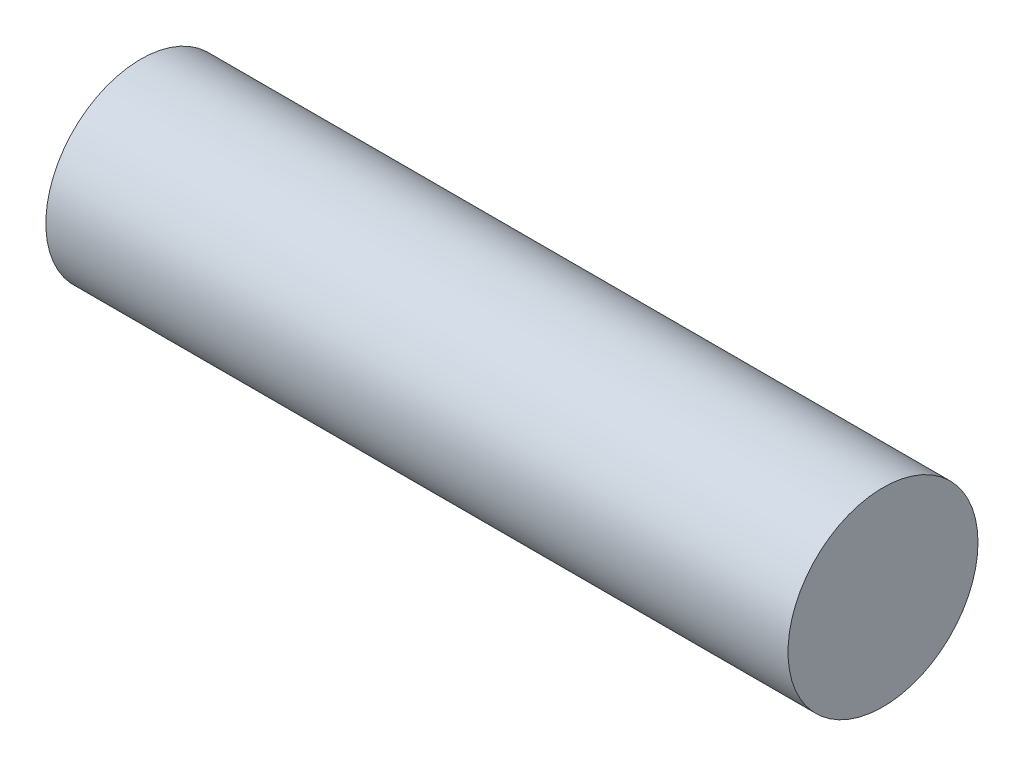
from build123d import *

# Parameters (mm, degrees)
SKETCH_1_R      = 0.65024
EXTRUDE_1_DEPTH = 2.54


with BuildPart() as part:
    # Sketch 1 → Extrude 1 (new, symmetric)
    with BuildSketch(Plane(origin=(0, 0, 0), x_dir=(0, 0, -1), z_dir=(1, 0, 0))):
        Circle(SKETCH_1_R)
    extrude(amount=EXTRUDE_1_DEPTH, both=True)


solid = part.part
